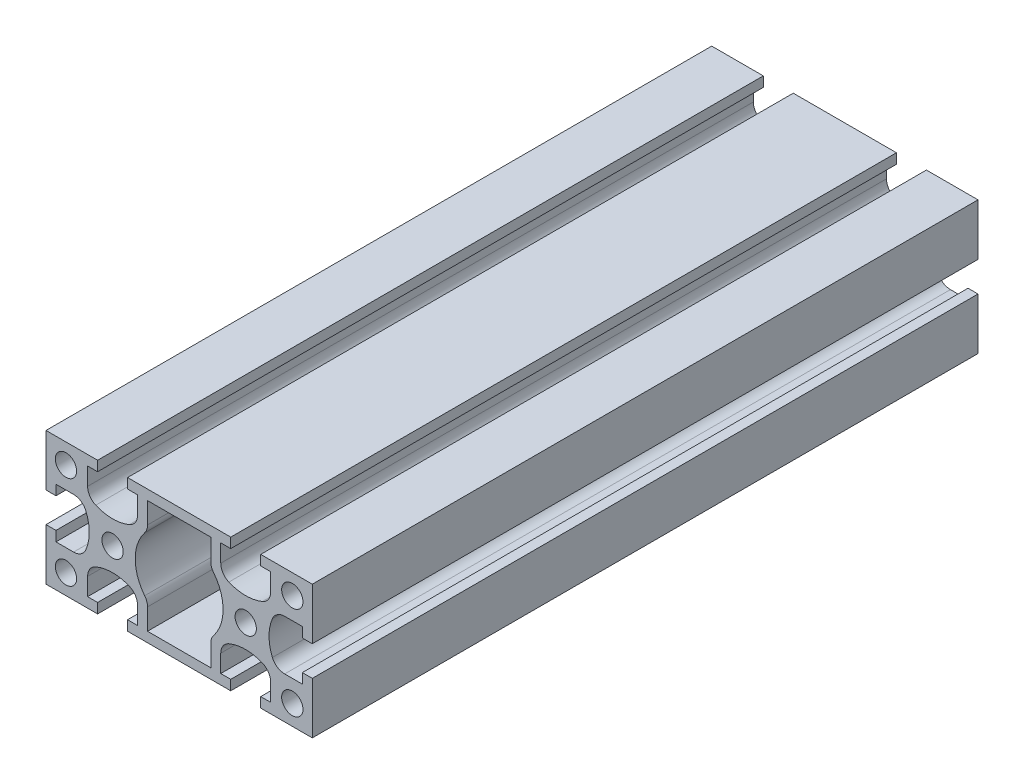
from build123d import *

# Parameters (mm, degrees)
SKETCH_1_R      = 1.6
EXTRUDE_1_DEPTH = 50
FILLET_1_R      = 2


with BuildPart() as part:
    # Sketch 1 → Extrude 1 (new, symmetric)
    with BuildSketch(Plane.XY):
        with BuildLine():
            Line((6.25, 8.5), (6.25, 4.690809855))
            ThreePointArc((6.25, 4.690809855), (10, 3.5), (13.75, 4.690809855))
            Line((13.75, 4.690809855), (13.75, 8.5))
            Line((13.75, 8.5), (12.25, 8.5))
            Line((12.25, 8.5), (12.25, 10))
            Line((12.25, 10), (20, 10))
            Line((20, 10), (20, 2.25))
            Line((20, 2.25), (18.5, 2.25))
            Line((18.5, 2.25), (18.5, 3.75))
            Line((18.5, 3.75), (14.690809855, 3.75))
            ThreePointArc((14.690809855, 3.75), (13.5, 0), (14.690809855, -3.75))
            Line((14.690809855, -3.75), (18.5, -3.75))
            Line((18.5, -3.75), (18.5, -2.25))
            Line((18.5, -2.25), (20, -2.25))
            Line((20, -2.25), (20, -10))
            Line((20, -10), (12.25, -10))
            Line((12.25, -10), (12.25, -8.5))
            Line((12.25, -8.5), (13.75, -8.5))
            Line((13.75, -8.5), (13.75, -4.690809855))
            ThreePointArc((13.75, -4.690809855), (10, -3.5), (6.25, -4.690809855))
            Line((6.25, -4.690809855), (6.25, -8.5))
            Line((6.25, -8.5), (7.75, -8.5))
            Line((7.75, -8.5), (7.75, -10))
            Line((7.75, -10), (-7.75, -10))
            Line((-7.75, -10), (-7.75, -8.5))
            Line((-7.75, -8.5), (-6.25, -8.5))
            Line((-6.25, -8.5), (-6.25, -4.690809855))
            ThreePointArc((-6.25, -4.690809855), (-10, -3.5), (-13.75, -4.690809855))
            Line((-13.75, -4.690809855), (-13.75, -8.5))
            Line((-13.75, -8.5), (-12.25, -8.5))
            Line((-12.25, -8.5), (-12.25, -10))
            Line((-12.25, -10), (-20, -10))
            Line((-20, -10), (-20, -2.25))
            Line((-20, -2.25), (-18.5, -2.25))
            Line((-18.5, -2.25), (-18.5, -3.75))
            Line((-18.5, -3.75), (-14.690809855, -3.75))
            ThreePointArc((-14.690809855, -3.75), (-13.5, 0), (-14.690809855, 3.75))
            Line((-14.690809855, 3.75), (-18.5, 3.75))
            Line((-18.5, 3.75), (-18.5, 2.25))
            Line((-18.5, 2.25), (-20, 2.25))
            Line((-20, 2.25), (-20, 10))
            Line((-20, 10), (-12.25, 10))
            Line((-12.25, 10), (-12.25, 8.5))
            Line((-12.25, 8.5), (-13.75, 8.5))
            Line((-13.75, 8.5), (-13.75, 4.690809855))
            ThreePointArc((-13.75, 4.690809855), (-10, 3.5), (-6.25, 4.690809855))
            Line((-6.25, 4.690809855), (-6.25, 8.5))
            Line((-6.25, 8.5), (-7.75, 8.5))
            Line((-7.75, 8.5), (-7.75, 10))
            Line((-7.75, 10), (7.75, 10))
            Line((7.75, 10), (7.75, 8.5))
            Line((7.75, 8.5), (6.25, 8.5))
        make_face()
        with Locations((17, 7)):
            Circle(SKETCH_1_R, mode=Mode.SUBTRACT)
        with Locations((10, 0)):
            Circle(SKETCH_1_R, mode=Mode.SUBTRACT)
        with Locations(Location((17, -7, 0), (0, 0, 180))):
            Circle(SKETCH_1_R, mode=Mode.SUBTRACT)
        with Locations(Location((-10, 0, 0), (0, 0, 180))):
            Circle(SKETCH_1_R, mode=Mode.SUBTRACT)
        with Locations((-17, -7)):
            Circle(SKETCH_1_R, mode=Mode.SUBTRACT)
        with Locations(Location((-17, 7, 0), (0, 0, 180))):
            Circle(SKETCH_1_R, mode=Mode.SUBTRACT)
        with BuildLine():
            Line((-4.75, 8.5), (4.75, 8.5))
            Line((4.75, 8.5), (4.75, 4.582302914))
            ThreePointArc((4.75, 4.582302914), (6.6, 0), (4.75, -4.582302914))
            Line((4.75, -4.582302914), (4.75, -8.5))
            Line((4.75, -8.5), (-4.75, -8.5))
            Line((-4.75, -8.5), (-4.75, -4.582302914))
            ThreePointArc((-4.75, -4.582302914), (-6.6, 0), (-4.75, 4.582302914))
            Line((-4.75, 4.582302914), (-4.75, 8.5))
        make_face(mode=Mode.SUBTRACT)
    extrude(amount=EXTRUDE_1_DEPTH, both=True)

    # Fillet 1
    fillet_1_edges = [part.edges().sort_by_distance(p)[0] for p in [
        (4.75, 4.582302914, 0),
        (-4.75, 4.582302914, 0),
        (-4.75, -4.582302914, 0),
        (4.75, -4.582302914, 0),
        (6.25, 4.690809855, 0),
        (13.75, 4.690809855, 0),
        (14.690809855, 3.75, 0),
        (14.690809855, -3.75, 0),
        (13.75, -4.690809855, 0),
        (6.25, -4.690809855, 0),
        (-6.25, -4.690809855, 0),
        (-13.75, -4.690809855, 0),
        (-14.690809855, -3.75, 0),
        (-14.690809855, 3.75, 0),
        (-13.75, 4.690809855, 0),
        (-6.25, 4.690809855, 0),
    ]]
    fillet(fillet_1_edges, radius=FILLET_1_R)


solid = part.part
